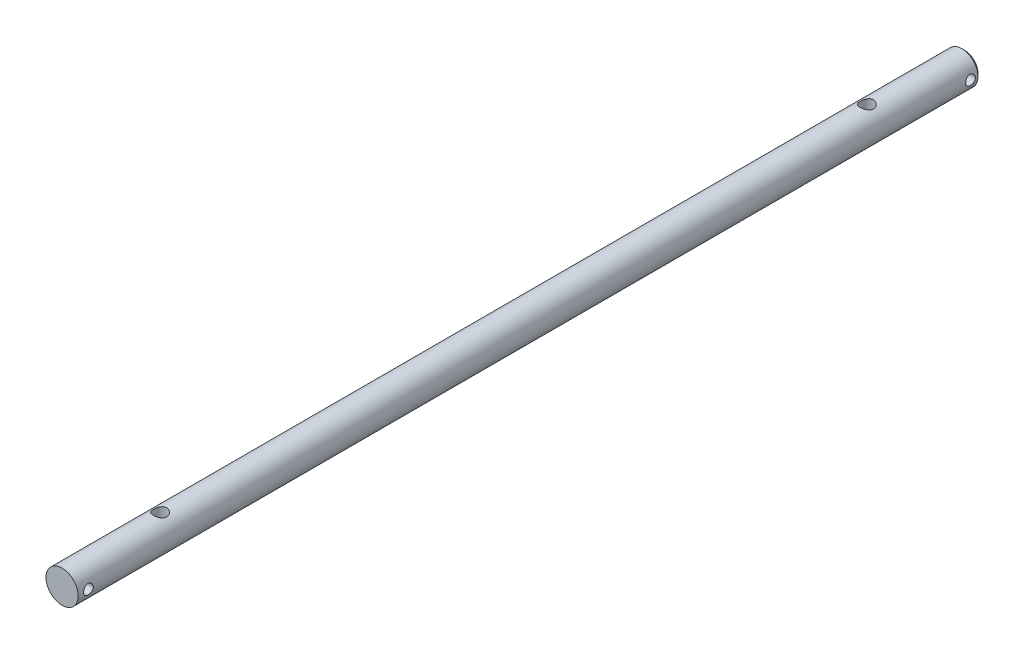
ISO-10303-21;
HEADER;
FILE_DESCRIPTION(('STEP AP214'),'2;1');
FILE_NAME('part.step','',(''),(''),'','','');
FILE_SCHEMA(('AUTOMOTIVE_DESIGN { 1 0 10303 214 1 1 1 1 }'));
ENDSEC;
DATA;
#1=APPLICATION_CONTEXT('core data for automotive mechanical design processes');
#2=APPLICATION_PROTOCOL_DEFINITION('international standard','automotive_design',2000,#1);
#3=PRODUCT_CONTEXT('',#1,'mechanical');
#4=PRODUCT('Part','Part','',(#3));
#5=PRODUCT_RELATED_PRODUCT_CATEGORY('part','',(#4));
#6=PRODUCT_DEFINITION_FORMATION('','',#4);
#7=PRODUCT_DEFINITION_CONTEXT('part definition',#1,'design');
#8=PRODUCT_DEFINITION('design','',#6,#7);
#9=PRODUCT_DEFINITION_SHAPE('','',#8);
#10=(LENGTH_UNIT() NAMED_UNIT(*) SI_UNIT(.MILLI.,.METRE.));
#11=(NAMED_UNIT(*) PLANE_ANGLE_UNIT() SI_UNIT($,.RADIAN.));
#12=(NAMED_UNIT(*) SI_UNIT($,.STERADIAN.) SOLID_ANGLE_UNIT());
#13=UNCERTAINTY_MEASURE_WITH_UNIT(LENGTH_MEASURE(1.E-05),#10,'distance_accuracy_value','');
#14=(GEOMETRIC_REPRESENTATION_CONTEXT(3) GLOBAL_UNCERTAINTY_ASSIGNED_CONTEXT((#13)) GLOBAL_UNIT_ASSIGNED_CONTEXT((#10,
#11,#12)) REPRESENTATION_CONTEXT('',''));
#15=CARTESIAN_POINT('',(0.,0.,0.));
#16=DIRECTION('',(0.,0.,1.));
#17=DIRECTION('',(1.,0.,0.));
#18=AXIS2_PLACEMENT_3D('',#15,#16,#17);
#19=CARTESIAN_POINT('',(0.,0.,444.5));
#20=DIRECTION('',(0.,0.,-1.));
#21=DIRECTION('',(-1.,0.,0.));
#22=AXIS2_PLACEMENT_3D('',#19,#20,#21);
#23=CYLINDRICAL_SURFACE('',#22,7.9375);
#24=CARTESIAN_POINT('',(0.,0.,1.41824457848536));
#25=DIRECTION('',(0.,0.,1.));
#26=DIRECTION('',(1.,0.,0.));
#27=AXIS2_PLACEMENT_3D('',#24,#25,#26);
#28=CIRCLE('',#27,7.9375);
#29=CARTESIAN_POINT('',(7.9375,0.,1.41824457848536));
#30=VERTEX_POINT('',#29);
#31=EDGE_CURVE('E122',#30,#30,#28,.T.);
#32=ORIENTED_EDGE('',*,*,#31,.T.);
#33=EDGE_LOOP('',(#32));
#34=FACE_BOUND('',#33,.T.);
#35=CARTESIAN_POINT('',(0.,-7.9375,51.5239));
#36=CARTESIAN_POINT('',(0.0875530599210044,-7.93749934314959,51.5238990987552));
#37=CARTESIAN_POINT('',(0.175141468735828,-7.93604590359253,51.5203699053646));
#38=CARTESIAN_POINT('',(0.349674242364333,-7.93027671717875,51.5062990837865));
#39=CARTESIAN_POINT('',(0.436618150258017,-7.92595910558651,51.4957528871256));
#40=CARTESIAN_POINT('',(0.695857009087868,-7.9088288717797,51.4536551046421));
#41=CARTESIAN_POINT('',(0.866314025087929,-7.89183927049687,51.4116446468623));
#42=CARTESIAN_POINT('',(1.19655692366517,-7.84856059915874,51.3016368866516));
#43=CARTESIAN_POINT('',(1.35637647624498,-7.8223027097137,51.2337266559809));
#44=CARTESIAN_POINT('',(1.66224186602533,-7.76306120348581,51.0742018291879));
#45=CARTESIAN_POINT('',(1.80829205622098,-7.73007972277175,50.9825947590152));
#46=CARTESIAN_POINT('',(2.08983259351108,-7.65888683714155,50.7735161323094));
#47=CARTESIAN_POINT('',(2.22455413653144,-7.6205070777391,50.6550677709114));
#48=CARTESIAN_POINT('',(2.47288037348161,-7.5435865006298,50.3977328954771));
#49=CARTESIAN_POINT('',(2.58647421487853,-7.50504561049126,50.2588359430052));
#50=CARTESIAN_POINT('',(2.79465670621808,-7.43011705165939,49.9565225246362));
#51=CARTESIAN_POINT('',(2.88808252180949,-7.39391935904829,49.7922533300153));
#52=CARTESIAN_POINT('',(3.04563418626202,-7.33043566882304,49.4486250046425));
#53=CARTESIAN_POINT('',(3.1097747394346,-7.30314520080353,49.2692735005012));
#54=CARTESIAN_POINT('',(3.20378358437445,-7.26238292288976,48.9094115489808));
#55=CARTESIAN_POINT('',(3.23512819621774,-7.24831904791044,48.7293563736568));
#56=CARTESIAN_POINT('',(3.26726348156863,-7.23389512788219,48.3660351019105));
#57=CARTESIAN_POINT('',(3.26807038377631,-7.23352780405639,48.1827707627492));
#58=CARTESIAN_POINT('',(3.24022153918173,-7.24603607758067,47.8327624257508));
#59=CARTESIAN_POINT('',(3.21375012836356,-7.25792988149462,47.6658025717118));
#60=CARTESIAN_POINT('',(3.13575278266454,-7.29196488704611,47.3389464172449));
#61=CARTESIAN_POINT('',(3.08422219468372,-7.3141079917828,47.1790514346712));
#62=CARTESIAN_POINT('',(2.95657151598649,-7.3666425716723,46.8668836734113));
#63=CARTESIAN_POINT('',(2.87995763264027,-7.39719754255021,46.7148415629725));
#64=CARTESIAN_POINT('',(2.70466340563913,-7.46307273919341,46.4251908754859));
#65=CARTESIAN_POINT('',(2.6059744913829,-7.49839481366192,46.2875879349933));
#66=CARTESIAN_POINT('',(2.37981547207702,-7.57335383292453,46.0188314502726));
#67=CARTESIAN_POINT('',(2.25064758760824,-7.61310693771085,45.8891350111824));
#68=CARTESIAN_POINT('',(1.97199073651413,-7.68999570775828,45.6527630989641));
#69=CARTESIAN_POINT('',(1.82249726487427,-7.72713078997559,45.5460927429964));
#70=CARTESIAN_POINT('',(1.50310308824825,-7.79562728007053,45.3567397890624));
#71=CARTESIAN_POINT('',(1.33282650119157,-7.82684408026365,45.2746350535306));
#72=CARTESIAN_POINT('',(0.979267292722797,-7.87888249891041,45.1407441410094));
#73=CARTESIAN_POINT('',(0.795991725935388,-7.89970970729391,45.0889416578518));
#74=CARTESIAN_POINT('',(0.433826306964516,-7.9275865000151,45.0201412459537));
#75=CARTESIAN_POINT('',(0.255367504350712,-7.93540929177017,45.0011869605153));
#76=CARTESIAN_POINT('',(-0.102336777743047,-7.93885310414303,44.9928070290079));
#77=CARTESIAN_POINT('',(-0.281582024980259,-7.93447751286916,45.0033731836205));
#78=CARTESIAN_POINT('',(-0.626707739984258,-7.91451937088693,45.0523207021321));
#79=CARTESIAN_POINT('',(-0.792816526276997,-7.89948546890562,45.0893410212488));
#80=CARTESIAN_POINT('',(-1.11629339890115,-7.86030273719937,45.1882658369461));
#81=CARTESIAN_POINT('',(-1.27366037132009,-7.83615274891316,45.2501734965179));
#82=CARTESIAN_POINT('',(-1.58067601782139,-7.78013402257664,45.3991396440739));
#83=CARTESIAN_POINT('',(-1.72993527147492,-7.74804959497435,45.4869170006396));
#84=CARTESIAN_POINT('',(-2.01213722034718,-7.67960474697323,45.6843386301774));
#85=CARTESIAN_POINT('',(-2.14507314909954,-7.64324256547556,45.7939919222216));
#86=CARTESIAN_POINT('',(-2.4005839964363,-7.56704039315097,46.0409983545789));
#87=CARTESIAN_POINT('',(-2.52179169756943,-7.52713460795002,46.179749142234));
#88=CARTESIAN_POINT('',(-2.73956909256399,-7.4506391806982,46.4762819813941));
#89=CARTESIAN_POINT('',(-2.83613372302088,-7.4140502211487,46.6340679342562));
#90=CARTESIAN_POINT('',(-3.00277654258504,-7.34815673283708,46.9671472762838));
#91=CARTESIAN_POINT('',(-3.07250365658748,-7.3189503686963,47.1426371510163));
#92=CARTESIAN_POINT('',(-3.18084236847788,-7.27252962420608,47.5044409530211));
#93=CARTESIAN_POINT('',(-3.21947872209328,-7.25530570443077,47.6907461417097));
#94=CARTESIAN_POINT('',(-3.26210992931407,-7.23623107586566,48.0537645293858));
#95=CARTESIAN_POINT('',(-3.26849573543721,-7.23331975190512,48.2301426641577));
#96=CARTESIAN_POINT('',(-3.25279307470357,-7.24039494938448,48.5813450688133));
#97=CARTESIAN_POINT('',(-3.23070871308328,-7.25037961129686,48.7561695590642));
#98=CARTESIAN_POINT('',(-3.1606832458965,-7.28116335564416,49.0913614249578));
#99=CARTESIAN_POINT('',(-3.11392710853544,-7.30146537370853,49.2520262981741));
#100=CARTESIAN_POINT('',(-2.99702644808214,-7.35021956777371,49.5632774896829));
#101=CARTESIAN_POINT('',(-2.92687538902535,-7.37867402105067,49.7138609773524));
#102=CARTESIAN_POINT('',(-2.76038854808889,-7.44261733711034,50.0104015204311));
#103=CARTESIAN_POINT('',(-2.66274810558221,-7.47842299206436,50.1555564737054));
#104=CARTESIAN_POINT('',(-2.44589930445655,-7.55212412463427,50.4281726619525));
#105=CARTESIAN_POINT('',(-2.32668378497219,-7.59002029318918,50.5556279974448));
#106=CARTESIAN_POINT('',(-2.06016435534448,-7.6668232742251,50.7984061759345));
#107=CARTESIAN_POINT('',(-1.91147676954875,-7.70561451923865,50.9122508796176));
#108=CARTESIAN_POINT('',(-1.5955536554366,-7.77716179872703,51.1134652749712));
#109=CARTESIAN_POINT('',(-1.4283096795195,-7.8099150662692,51.2008228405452));
#110=CARTESIAN_POINT('',(-1.16866980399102,-7.85147733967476,51.3089159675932));
#111=CARTESIAN_POINT('',(-1.08141427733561,-7.86399724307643,51.3409508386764));
#112=CARTESIAN_POINT('',(-0.904186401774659,-7.88633656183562,51.3975347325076));
#113=CARTESIAN_POINT('',(-0.814215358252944,-7.89615725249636,51.4220872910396));
#114=CARTESIAN_POINT('',(-0.632474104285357,-7.91278688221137,51.463386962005));
#115=CARTESIAN_POINT('',(-0.540708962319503,-7.91960330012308,51.4801534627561));
#116=CARTESIAN_POINT('',(-0.355946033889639,-7.93005394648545,51.5057712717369));
#117=CARTESIAN_POINT('',(-0.262949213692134,-7.93369053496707,51.5146284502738));
#118=CARTESIAN_POINT('',(-0.141483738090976,-7.93628946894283,51.5209550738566));
#119=CARTESIAN_POINT('',(-0.11320114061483,-7.93674317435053,51.5220591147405));
#120=CARTESIAN_POINT('',(-0.0566135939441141,-7.93734854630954,51.5235317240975));
#121=CARTESIAN_POINT('',(-0.0283086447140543,-7.9375002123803,51.5239002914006));
#122=CARTESIAN_POINT('',(0.,-7.9375,51.5239));
#123=B_SPLINE_CURVE_WITH_KNOTS('',3,(#35,#36,#37,#38,#39,#40,#41,#42,#43,#44,#45,#46,#47,#48,
#49,#50,#51,#52,#53,#54,#55,#56,#57,#58,#59,#60,#61,#62,#63,#64,#65,#66,#67,#68,#69,#70,#71,#72,
#73,#74,#75,#76,#77,#78,#79,#80,#81,#82,#83,#84,#85,#86,#87,#88,#89,#90,#91,#92,#93,#94,#95,#96,
#97,#98,#99,#100,#101,#102,#103,#104,#105,#106,#107,#108,#109,#110,#111,#112,#113,#114,#115,
#116,#117,#118,#119,#120,#121,#122),.UNSPECIFIED.,.T.,.F.,(4,2,2,2,2,2,2,2,2,2,2,2,2,2,2,2,2,2,
2,2,2,2,2,2,2,2,2,2,2,2,2,2,2,2,2,2,2,2,2,2,2,2,2,4),(0.,0.262627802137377,0.525426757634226,
1.0517501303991,1.57631944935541,2.1007223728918,2.64867604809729,3.1969104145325,
3.77125564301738,4.34531217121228,4.89224140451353,5.438879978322,5.94490860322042,
6.45103122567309,6.9677855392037,7.48474083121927,8.0441401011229,8.60366356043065,
9.17546733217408,9.74696312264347,10.2830744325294,10.8190368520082,11.3292438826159,
11.8395157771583,12.3655746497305,12.8918508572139,13.4547946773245,14.017854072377,
14.5880472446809,15.1577859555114,15.6845933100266,16.2113247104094,16.7147943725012,
17.2184048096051,17.751839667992,18.2854519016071,18.856494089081,19.4277973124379,
19.7088571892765,19.9897840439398,20.270007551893,20.5500229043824,20.6349385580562,
20.7198543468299),.UNSPECIFIED.);
#124=CARTESIAN_POINT('',(0.,-7.9375,51.5239));
#125=VERTEX_POINT('',#124);
#126=EDGE_CURVE('E43',#125,#125,#123,.T.);
#127=ORIENTED_EDGE('',*,*,#126,.T.);
#128=EDGE_LOOP('',(#127));
#129=FACE_BOUND('',#128,.T.);
#130=CARTESIAN_POINT('',(0.,7.9375,51.5239));
#131=CARTESIAN_POINT('',(-0.0875530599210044,7.93749934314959,51.5238990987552));
#132=CARTESIAN_POINT('',(-0.175141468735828,7.93604590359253,51.5203699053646));
#133=CARTESIAN_POINT('',(-0.349674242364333,7.93027671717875,51.5062990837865));
#134=CARTESIAN_POINT('',(-0.436618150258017,7.92595910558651,51.4957528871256));
#135=CARTESIAN_POINT('',(-0.695857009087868,7.9088288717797,51.4536551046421));
#136=CARTESIAN_POINT('',(-0.866314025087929,7.89183927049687,51.4116446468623));
#137=CARTESIAN_POINT('',(-1.19655692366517,7.84856059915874,51.3016368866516));
#138=CARTESIAN_POINT('',(-1.35637647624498,7.8223027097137,51.2337266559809));
#139=CARTESIAN_POINT('',(-1.66224186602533,7.76306120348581,51.0742018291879));
#140=CARTESIAN_POINT('',(-1.80829205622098,7.73007972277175,50.9825947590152));
#141=CARTESIAN_POINT('',(-2.08983259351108,7.65888683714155,50.7735161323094));
#142=CARTESIAN_POINT('',(-2.22455413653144,7.6205070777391,50.6550677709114));
#143=CARTESIAN_POINT('',(-2.47288037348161,7.5435865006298,50.3977328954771));
#144=CARTESIAN_POINT('',(-2.58647421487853,7.50504561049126,50.2588359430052));
#145=CARTESIAN_POINT('',(-2.79465670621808,7.43011705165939,49.9565225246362));
#146=CARTESIAN_POINT('',(-2.88808252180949,7.39391935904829,49.7922533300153));
#147=CARTESIAN_POINT('',(-3.04563418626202,7.33043566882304,49.4486250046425));
#148=CARTESIAN_POINT('',(-3.1097747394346,7.30314520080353,49.2692735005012));
#149=CARTESIAN_POINT('',(-3.20378358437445,7.26238292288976,48.9094115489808));
#150=CARTESIAN_POINT('',(-3.23512819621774,7.24831904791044,48.7293563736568));
#151=CARTESIAN_POINT('',(-3.26726348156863,7.23389512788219,48.3660351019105));
#152=CARTESIAN_POINT('',(-3.26807038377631,7.23352780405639,48.1827707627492));
#153=CARTESIAN_POINT('',(-3.24022153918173,7.24603607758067,47.8327624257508));
#154=CARTESIAN_POINT('',(-3.21375012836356,7.25792988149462,47.6658025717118));
#155=CARTESIAN_POINT('',(-3.13575278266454,7.29196488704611,47.3389464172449));
#156=CARTESIAN_POINT('',(-3.08422219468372,7.3141079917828,47.1790514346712));
#157=CARTESIAN_POINT('',(-2.95657151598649,7.3666425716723,46.8668836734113));
#158=CARTESIAN_POINT('',(-2.87995763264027,7.39719754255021,46.7148415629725));
#159=CARTESIAN_POINT('',(-2.70466340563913,7.46307273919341,46.4251908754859));
#160=CARTESIAN_POINT('',(-2.6059744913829,7.49839481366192,46.2875879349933));
#161=CARTESIAN_POINT('',(-2.37981547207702,7.57335383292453,46.0188314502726));
#162=CARTESIAN_POINT('',(-2.25064758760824,7.61310693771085,45.8891350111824));
#163=CARTESIAN_POINT('',(-1.97199073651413,7.68999570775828,45.6527630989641));
#164=CARTESIAN_POINT('',(-1.82249726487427,7.72713078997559,45.5460927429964));
#165=CARTESIAN_POINT('',(-1.50310308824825,7.79562728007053,45.3567397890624));
#166=CARTESIAN_POINT('',(-1.33282650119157,7.82684408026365,45.2746350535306));
#167=CARTESIAN_POINT('',(-0.979267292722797,7.87888249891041,45.1407441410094));
#168=CARTESIAN_POINT('',(-0.795991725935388,7.89970970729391,45.0889416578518));
#169=CARTESIAN_POINT('',(-0.433826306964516,7.9275865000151,45.0201412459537));
#170=CARTESIAN_POINT('',(-0.255367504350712,7.93540929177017,45.0011869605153));
#171=CARTESIAN_POINT('',(0.102336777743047,7.93885310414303,44.9928070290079));
#172=CARTESIAN_POINT('',(0.281582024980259,7.93447751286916,45.0033731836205));
#173=CARTESIAN_POINT('',(0.626707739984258,7.91451937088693,45.0523207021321));
#174=CARTESIAN_POINT('',(0.792816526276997,7.89948546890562,45.0893410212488));
#175=CARTESIAN_POINT('',(1.11629339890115,7.86030273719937,45.1882658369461));
#176=CARTESIAN_POINT('',(1.27366037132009,7.83615274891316,45.2501734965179));
#177=CARTESIAN_POINT('',(1.58067601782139,7.78013402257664,45.3991396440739));
#178=CARTESIAN_POINT('',(1.72993527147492,7.74804959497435,45.4869170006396));
#179=CARTESIAN_POINT('',(2.01213722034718,7.67960474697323,45.6843386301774));
#180=CARTESIAN_POINT('',(2.14507314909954,7.64324256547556,45.7939919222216));
#181=CARTESIAN_POINT('',(2.4005839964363,7.56704039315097,46.0409983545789));
#182=CARTESIAN_POINT('',(2.52179169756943,7.52713460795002,46.179749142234));
#183=CARTESIAN_POINT('',(2.73956909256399,7.4506391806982,46.4762819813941));
#184=CARTESIAN_POINT('',(2.83613372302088,7.4140502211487,46.6340679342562));
#185=CARTESIAN_POINT('',(3.00277654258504,7.34815673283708,46.9671472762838));
#186=CARTESIAN_POINT('',(3.07250365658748,7.3189503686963,47.1426371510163));
#187=CARTESIAN_POINT('',(3.18084236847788,7.27252962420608,47.5044409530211));
#188=CARTESIAN_POINT('',(3.21947872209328,7.25530570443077,47.6907461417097));
#189=CARTESIAN_POINT('',(3.26210992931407,7.23623107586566,48.0537645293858));
#190=CARTESIAN_POINT('',(3.26849573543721,7.23331975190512,48.2301426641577));
#191=CARTESIAN_POINT('',(3.25279307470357,7.24039494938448,48.5813450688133));
#192=CARTESIAN_POINT('',(3.23070871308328,7.25037961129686,48.7561695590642));
#193=CARTESIAN_POINT('',(3.1606832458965,7.28116335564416,49.0913614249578));
#194=CARTESIAN_POINT('',(3.11392710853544,7.30146537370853,49.2520262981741));
#195=CARTESIAN_POINT('',(2.99702644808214,7.35021956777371,49.5632774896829));
#196=CARTESIAN_POINT('',(2.92687538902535,7.37867402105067,49.7138609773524));
#197=CARTESIAN_POINT('',(2.76038854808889,7.44261733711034,50.0104015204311));
#198=CARTESIAN_POINT('',(2.66274810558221,7.47842299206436,50.1555564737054));
#199=CARTESIAN_POINT('',(2.44589930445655,7.55212412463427,50.4281726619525));
#200=CARTESIAN_POINT('',(2.32668378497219,7.59002029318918,50.5556279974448));
#201=CARTESIAN_POINT('',(2.06016435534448,7.6668232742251,50.7984061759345));
#202=CARTESIAN_POINT('',(1.91147676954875,7.70561451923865,50.9122508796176));
#203=CARTESIAN_POINT('',(1.5955536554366,7.77716179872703,51.1134652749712));
#204=CARTESIAN_POINT('',(1.4283096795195,7.8099150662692,51.2008228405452));
#205=CARTESIAN_POINT('',(1.16866980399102,7.85147733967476,51.3089159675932));
#206=CARTESIAN_POINT('',(1.08141427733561,7.86399724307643,51.3409508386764));
#207=CARTESIAN_POINT('',(0.904186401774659,7.88633656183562,51.3975347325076));
#208=CARTESIAN_POINT('',(0.814215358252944,7.89615725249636,51.4220872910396));
#209=CARTESIAN_POINT('',(0.632474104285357,7.91278688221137,51.463386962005));
#210=CARTESIAN_POINT('',(0.540708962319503,7.91960330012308,51.4801534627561));
#211=CARTESIAN_POINT('',(0.355946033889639,7.93005394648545,51.5057712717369));
#212=CARTESIAN_POINT('',(0.262949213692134,7.93369053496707,51.5146284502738));
#213=CARTESIAN_POINT('',(0.141483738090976,7.93628946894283,51.5209550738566));
#214=CARTESIAN_POINT('',(0.11320114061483,7.93674317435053,51.5220591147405));
#215=CARTESIAN_POINT('',(0.0566135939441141,7.93734854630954,51.5235317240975));
#216=CARTESIAN_POINT('',(0.0283086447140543,7.9375002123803,51.5239002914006));
#217=CARTESIAN_POINT('',(0.,7.9375,51.5239));
#218=B_SPLINE_CURVE_WITH_KNOTS('',3,(#130,#131,#132,#133,#134,#135,#136,#137,#138,#139,#140,
#141,#142,#143,#144,#145,#146,#147,#148,#149,#150,#151,#152,#153,#154,#155,#156,#157,#158,#159,
#160,#161,#162,#163,#164,#165,#166,#167,#168,#169,#170,#171,#172,#173,#174,#175,#176,#177,#178,
#179,#180,#181,#182,#183,#184,#185,#186,#187,#188,#189,#190,#191,#192,#193,#194,#195,#196,#197,
#198,#199,#200,#201,#202,#203,#204,#205,#206,#207,#208,#209,#210,#211,#212,#213,#214,#215,#216,
#217),.UNSPECIFIED.,.T.,.F.,(4,2,2,2,2,2,2,2,2,2,2,2,2,2,2,2,2,2,2,2,2,2,2,2,2,2,2,2,2,2,2,2,2,
2,2,2,2,2,2,2,2,2,2,4),(0.,0.262627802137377,0.525426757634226,1.0517501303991,1.57631944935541,
2.1007223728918,2.64867604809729,3.1969104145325,3.77125564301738,4.34531217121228,
4.89224140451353,5.438879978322,5.94490860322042,6.45103122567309,6.9677855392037,
7.48474083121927,8.0441401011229,8.60366356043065,9.17546733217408,9.74696312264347,
10.2830744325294,10.8190368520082,11.3292438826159,11.8395157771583,12.3655746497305,
12.8918508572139,13.4547946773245,14.017854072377,14.5880472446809,15.1577859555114,
15.6845933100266,16.2113247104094,16.7147943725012,17.2184048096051,17.751839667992,
18.2854519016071,18.856494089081,19.4277973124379,19.7088571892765,19.9897840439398,
20.270007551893,20.5500229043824,20.6349385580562,20.7198543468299),.UNSPECIFIED.);
#219=CARTESIAN_POINT('',(0.,7.9375,51.5239));
#220=VERTEX_POINT('',#219);
#221=EDGE_CURVE('E69',#220,#220,#218,.T.);
#222=ORIENTED_EDGE('',*,*,#221,.T.);
#223=EDGE_LOOP('',(#222));
#224=FACE_BOUND('',#223,.T.);
#225=CARTESIAN_POINT('',(-7.9375,0.,7.45648797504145));
#226=CARTESIAN_POINT('',(-7.93749890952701,-0.130707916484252,7.44820757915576));
#227=CARTESIAN_POINT('',(-7.9342407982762,-0.260747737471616,7.4291101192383));
#228=CARTESIAN_POINT('',(-7.92176105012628,-0.515673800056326,7.36990702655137));
#229=CARTESIAN_POINT('',(-7.91253734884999,-0.640558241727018,7.32979412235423));
#230=CARTESIAN_POINT('',(-7.88932878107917,-0.881496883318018,7.22994742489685));
#231=CARTESIAN_POINT('',(-7.87535113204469,-0.997564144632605,7.17024337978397));
#232=CARTESIAN_POINT('',(-7.84426616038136,-1.21812021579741,7.03296056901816));
#233=CARTESIAN_POINT('',(-7.82715846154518,-1.32260763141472,6.9553796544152));
#234=CARTESIAN_POINT('',(-7.79127519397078,-1.51995497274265,6.78221332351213));
#235=CARTESIAN_POINT('',(-7.77246826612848,-1.61245146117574,6.68622007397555));
#236=CARTESIAN_POINT('',(-7.73576226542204,-1.78024816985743,6.48005405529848));
#237=CARTESIAN_POINT('',(-7.71786329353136,-1.85554648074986,6.36987971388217));
#238=CARTESIAN_POINT('',(-7.68485304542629,-1.98788376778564,6.13634402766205));
#239=CARTESIAN_POINT('',(-7.66978929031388,-2.04462156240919,6.01280471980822));
#240=CARTESIAN_POINT('',(-7.64474544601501,-2.13636526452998,5.75742199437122));
#241=CARTESIAN_POINT('',(-7.63476406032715,-2.17137671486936,5.6255807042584));
#242=CARTESIAN_POINT('',(-7.62143239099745,-2.21771146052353,5.36152755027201));
#243=CARTESIAN_POINT('',(-7.61789351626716,-2.22970902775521,5.22944360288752));
#244=CARTESIAN_POINT('',(-7.61733309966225,-2.23162428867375,4.96511369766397));
#245=CARTESIAN_POINT('',(-7.62031056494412,-2.22154534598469,4.83286776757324));
#246=CARTESIAN_POINT('',(-7.63222803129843,-2.18023753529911,4.57555905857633));
#247=CARTESIAN_POINT('',(-7.64101121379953,-2.14956459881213,4.45039892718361));
#248=CARTESIAN_POINT('',(-7.6633114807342,-2.06864970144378,4.20702494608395));
#249=CARTESIAN_POINT('',(-7.67682919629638,-2.0184051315,4.08881202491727));
#250=CARTESIAN_POINT('',(-7.70734938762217,-1.8985675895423,3.85990525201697));
#251=CARTESIAN_POINT('',(-7.72441938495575,-1.82858866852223,3.74942273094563));
#252=CARTESIAN_POINT('',(-7.75989375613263,-1.67165011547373,3.54148753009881));
#253=CARTESIAN_POINT('',(-7.77829841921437,-1.58468679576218,3.44403768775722));
#254=CARTESIAN_POINT('',(-7.8149880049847,-1.3927370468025,3.26153160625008));
#255=CARTESIAN_POINT('',(-7.83324790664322,-1.2872412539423,3.1770048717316));
#256=CARTESIAN_POINT('',(-7.86679382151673,-1.06314482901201,3.02681780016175));
#257=CARTESIAN_POINT('',(-7.88207998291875,-0.944544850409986,2.96115652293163));
#258=CARTESIAN_POINT('',(-7.90767767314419,-0.698373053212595,2.85115099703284));
#259=CARTESIAN_POINT('',(-7.91802493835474,-0.570873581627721,2.80665362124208));
#260=CARTESIAN_POINT('',(-7.93252461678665,-0.309866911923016,2.73980131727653));
#261=CARTESIAN_POINT('',(-7.93667873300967,-0.176361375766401,2.71744030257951));
#262=CARTESIAN_POINT('',(-7.93807397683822,0.0876213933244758,2.69603458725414));
#263=CARTESIAN_POINT('',(-7.93556185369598,0.218031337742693,2.69616876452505));
#264=CARTESIAN_POINT('',(-7.92422471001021,0.476803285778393,2.71763980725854));
#265=CARTESIAN_POINT('',(-7.91539999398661,0.605165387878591,2.73897564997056));
#266=CARTESIAN_POINT('',(-7.89229718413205,0.855086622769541,2.80175622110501));
#267=CARTESIAN_POINT('',(-7.87806916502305,0.976696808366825,2.84301722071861));
#268=CARTESIAN_POINT('',(-7.84543099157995,1.21126293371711,2.94423249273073));
#269=CARTESIAN_POINT('',(-7.8270200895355,1.32421732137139,3.00419010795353));
#270=CARTESIAN_POINT('',(-7.78701002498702,1.54243628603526,3.14344669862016));
#271=CARTESIAN_POINT('',(-7.76532393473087,1.6473103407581,3.22333247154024));
#272=CARTESIAN_POINT('',(-7.7213581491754,1.84243220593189,3.39921213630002));
#273=CARTESIAN_POINT('',(-7.69907830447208,1.93267629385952,3.49521011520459));
#274=CARTESIAN_POINT('',(-7.65547249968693,2.09887460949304,3.70426268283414));
#275=CARTESIAN_POINT('',(-7.6341990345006,2.17428628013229,3.81776088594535));
#276=CARTESIAN_POINT('',(-7.59579176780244,2.30488832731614,4.05649889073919));
#277=CARTESIAN_POINT('',(-7.57865728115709,2.36008205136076,4.18173674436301));
#278=CARTESIAN_POINT('',(-7.5508902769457,2.44745535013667,4.43783894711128));
#279=CARTESIAN_POINT('',(-7.54013298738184,2.48007880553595,4.56853775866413));
#280=CARTESIAN_POINT('',(-7.52593900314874,2.52283032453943,4.83393651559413));
#281=CARTESIAN_POINT('',(-7.52249969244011,2.5329664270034,4.96863501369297));
#282=CARTESIAN_POINT('',(-7.5233584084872,2.53040993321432,5.23148375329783));
#283=CARTESIAN_POINT('',(-7.52730339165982,2.51875900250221,5.35964667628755));
#284=CARTESIAN_POINT('',(-7.54177095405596,2.47509956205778,5.6120628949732));
#285=CARTESIAN_POINT('',(-7.55229371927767,2.44309047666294,5.73631608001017));
#286=CARTESIAN_POINT('',(-7.57870652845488,2.35987283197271,5.97742280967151));
#287=CARTESIAN_POINT('',(-7.59459061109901,2.30868559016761,6.09428440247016));
#288=CARTESIAN_POINT('',(-7.63004725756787,2.1886499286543,6.31794141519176));
#289=CARTESIAN_POINT('',(-7.64962067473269,2.11979742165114,6.42473449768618));
#290=CARTESIAN_POINT('',(-7.6914615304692,1.96270591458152,6.63043118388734));
#291=CARTESIAN_POINT('',(-7.7138111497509,1.87372557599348,6.72875231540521));
#292=CARTESIAN_POINT('',(-7.75816566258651,1.6806461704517,6.90935741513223));
#293=CARTESIAN_POINT('',(-7.7801704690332,1.57654334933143,6.99163738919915));
#294=CARTESIAN_POINT('',(-7.82220120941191,1.35289866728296,7.13987710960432));
#295=CARTESIAN_POINT('',(-7.84216125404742,1.2330271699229,7.20535978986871));
#296=CARTESIAN_POINT('',(-7.87736555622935,0.98329904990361,7.31504041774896));
#297=CARTESIAN_POINT('',(-7.89261234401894,0.853447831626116,7.35924979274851));
#298=CARTESIAN_POINT('',(-7.91541772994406,0.60327917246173,7.42092938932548));
#299=CARTESIAN_POINT('',(-7.9236716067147,0.483646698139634,7.44094072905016));
#300=CARTESIAN_POINT('',(-7.93471284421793,0.242485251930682,7.46254998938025));
#301=CARTESIAN_POINT('',(-7.93750100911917,0.120956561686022,7.464150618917));
#302=CARTESIAN_POINT('',(-7.9375,0.,7.45648797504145));
#303=B_SPLINE_CURVE_WITH_KNOTS('',3,(#225,#226,#227,#228,#229,#230,#231,#232,#233,#234,#235,
#236,#237,#238,#239,#240,#241,#242,#243,#244,#245,#246,#247,#248,#249,#250,#251,#252,#253,#254,
#255,#256,#257,#258,#259,#260,#261,#262,#263,#264,#265,#266,#267,#268,#269,#270,#271,#272,#273,
#274,#275,#276,#277,#278,#279,#280,#281,#282,#283,#284,#285,#286,#287,#288,#289,#290,#291,#292,
#293,#294,#295,#296,#297,#298,#299,#300,#301,#302),.UNSPECIFIED.,.T.,.F.,(4,2,2,2,2,2,2,2,2,2,2,
2,2,2,2,2,2,2,2,2,2,2,2,2,2,2,2,2,2,2,2,2,2,2,2,2,2,2,4),(0.,0.392462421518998,
0.785060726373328,1.17706562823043,1.56911767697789,1.97114376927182,2.37321447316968,
2.78151866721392,3.1897186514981,3.58576454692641,3.98175010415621,4.36745428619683,
4.75320990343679,5.14710646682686,5.54108864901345,5.94837227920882,6.35563560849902,
6.75990566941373,7.16406454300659,7.55347409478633,7.9428648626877,8.32873172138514,
8.71466760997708,9.11368746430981,9.51280868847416,9.92455977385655,10.3362426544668,
10.7395795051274,11.1427721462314,11.5271786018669,11.9115959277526,12.2955872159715,
12.6796674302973,13.0812758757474,13.4829841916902,13.8950807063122,14.3069556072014,
14.6701921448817,15.0333752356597),.UNSPECIFIED.);
#304=CARTESIAN_POINT('',(-7.9375,0.,7.45648797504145));
#305=VERTEX_POINT('',#304);
#306=EDGE_CURVE('E87',#305,#305,#303,.T.);
#307=ORIENTED_EDGE('',*,*,#306,.T.);
#308=EDGE_LOOP('',(#307));
#309=FACE_BOUND('',#308,.T.);
#310=CARTESIAN_POINT('',(7.93607269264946,0.150520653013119,2.69875000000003));
#311=CARTESIAN_POINT('',(7.93854156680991,0.0203059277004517,2.69875126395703));
#312=CARTESIAN_POINT('',(7.93777726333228,-0.109983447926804,2.70946578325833));
#313=CARTESIAN_POINT('',(7.9300585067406,-0.366894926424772,2.75199750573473));
#314=CARTESIAN_POINT('',(7.92310255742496,-0.49351613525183,2.78381980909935));
#315=CARTESIAN_POINT('',(7.90395291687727,-0.739342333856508,2.86746000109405));
#316=CARTESIAN_POINT('',(7.89176611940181,-0.858556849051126,2.91925156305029));
#317=CARTESIAN_POINT('',(7.86360672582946,-1.08665561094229,3.04125438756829));
#318=CARTESIAN_POINT('',(7.84763361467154,-1.19553844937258,3.11146815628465));
#319=CARTESIAN_POINT('',(7.81329362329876,-1.40272820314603,3.2702479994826));
#320=CARTESIAN_POINT('',(7.79487927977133,-1.50072615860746,3.35920686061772));
#321=CARTESIAN_POINT('',(7.75807065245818,-1.68068444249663,3.55211110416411));
#322=CARTESIAN_POINT('',(7.73967637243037,-1.76264215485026,3.65605892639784));
#323=CARTESIAN_POINT('',(7.70462771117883,-1.91010891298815,3.87898582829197));
#324=CARTESIAN_POINT('',(7.68802527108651,-1.97517918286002,3.99826420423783));
#325=CARTESIAN_POINT('',(7.65918084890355,-2.0842406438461,4.24658959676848));
#326=CARTESIAN_POINT('',(7.64693802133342,-2.12823592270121,4.37563471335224));
#327=CARTESIAN_POINT('',(7.62864664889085,-2.19289101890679,4.63676933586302));
#328=CARTESIAN_POINT('',(7.6224644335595,-2.21405549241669,4.76872423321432));
#329=CARTESIAN_POINT('',(7.61663919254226,-2.2340166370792,5.03444551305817));
#330=CARTESIAN_POINT('',(7.61699474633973,-2.23281816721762,5.16821149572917));
#331=CARTESIAN_POINT('',(7.62407457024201,-2.20851408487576,5.42918670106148));
#332=CARTESIAN_POINT('',(7.6305932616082,-2.18611559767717,5.55646831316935));
#333=CARTESIAN_POINT('',(7.6488918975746,-2.12119891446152,5.80538979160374));
#334=CARTESIAN_POINT('',(7.66067232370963,-2.07867887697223,5.92702914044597));
#335=CARTESIAN_POINT('',(7.68825837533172,-1.9742153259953,6.16290719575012));
#336=CARTESIAN_POINT('',(7.70411035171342,-1.9120461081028,6.27704028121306));
#337=CARTESIAN_POINT('',(7.73793553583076,-1.77018742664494,6.49350138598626));
#338=CARTESIAN_POINT('',(7.7559092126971,-1.6904940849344,6.59582678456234));
#339=CARTESIAN_POINT('',(7.79263325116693,-1.51238923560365,6.78968719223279));
#340=CARTESIAN_POINT('',(7.81138802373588,-1.41340086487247,6.88069228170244));
#341=CARTESIAN_POINT('',(7.84680489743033,-1.20129212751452,7.04492848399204));
#342=CARTESIAN_POINT('',(7.86346693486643,-1.08817133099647,7.11815905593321));
#343=CARTESIAN_POINT('',(7.8927193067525,-0.850441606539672,7.24485833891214));
#344=CARTESIAN_POINT('',(7.90529840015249,-0.725802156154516,7.29827254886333));
#345=CARTESIAN_POINT('',(7.92468544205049,-0.468867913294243,7.38325968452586));
#346=CARTESIAN_POINT('',(7.93149496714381,-0.336575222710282,7.41483857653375));
#347=CARTESIAN_POINT('',(7.93821918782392,-0.0730824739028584,7.4543370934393));
#348=CARTESIAN_POINT('',(7.93836709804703,0.0579934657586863,7.46304690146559));
#349=CARTESIAN_POINT('',(7.93214094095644,0.319630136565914,7.45883732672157));
#350=CARTESIAN_POINT('',(7.92576756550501,0.45019092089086,7.44592023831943));
#351=CARTESIAN_POINT('',(7.90717104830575,0.704661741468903,7.39942049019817));
#352=CARTESIAN_POINT('',(7.89505595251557,0.828649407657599,7.36621637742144));
#353=CARTESIAN_POINT('',(7.86609083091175,1.06921177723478,7.28060571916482));
#354=CARTESIAN_POINT('',(7.84924014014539,1.18578543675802,7.22819647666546));
#355=CARTESIAN_POINT('',(7.81181125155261,1.41173345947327,7.10404621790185));
#356=CARTESIAN_POINT('',(7.79114372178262,1.52082377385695,7.03181574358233));
#357=CARTESIAN_POINT('',(7.7483678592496,1.72559037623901,6.87066806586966));
#358=CARTESIAN_POINT('',(7.72625914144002,1.82126305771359,6.78174639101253));
#359=CARTESIAN_POINT('',(7.68193003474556,2.00016907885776,6.5857881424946));
#360=CARTESIAN_POINT('',(7.65973612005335,2.08280685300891,6.47820049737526));
#361=CARTESIAN_POINT('',(7.61852106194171,2.22886132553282,6.25012158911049));
#362=CARTESIAN_POINT('',(7.59949975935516,2.29227898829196,6.12963097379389));
#363=CARTESIAN_POINT('',(7.56699437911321,2.39739908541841,5.88003793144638));
#364=CARTESIAN_POINT('',(7.55346390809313,2.43928429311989,5.75101884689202));
#365=CARTESIAN_POINT('',(7.53339375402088,2.50058927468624,5.48723970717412));
#366=CARTESIAN_POINT('',(7.52685132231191,2.52001788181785,5.35248193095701));
#367=CARTESIAN_POINT('',(7.52172770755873,2.53526598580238,5.08791886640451));
#368=CARTESIAN_POINT('',(7.52278383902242,2.53216096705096,4.95818162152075));
#369=CARTESIAN_POINT('',(7.53187321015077,2.50499359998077,4.70118135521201));
#370=CARTESIAN_POINT('',(7.53990614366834,2.4809321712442,4.5739182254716));
#371=CARTESIAN_POINT('',(7.56184780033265,2.4132126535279,4.32718970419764));
#372=CARTESIAN_POINT('',(7.5756738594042,2.36982974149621,4.20764090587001));
#373=CARTESIAN_POINT('',(7.60769550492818,2.26492157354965,3.97742521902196));
#374=CARTESIAN_POINT('',(7.62589197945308,2.20339262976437,3.8667601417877));
#375=CARTESIAN_POINT('',(7.66562063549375,2.06102695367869,3.65258366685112));
#376=CARTESIAN_POINT('',(7.68725837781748,1.97950678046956,3.54954621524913));
#377=CARTESIAN_POINT('',(7.73109022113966,1.80072488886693,3.35827902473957));
#378=CARTESIAN_POINT('',(7.75328448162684,1.70345861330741,3.27005358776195));
#379=CARTESIAN_POINT('',(7.79681357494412,1.49186423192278,3.10780925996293));
#380=CARTESIAN_POINT('',(7.81809084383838,1.37705685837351,3.03439817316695));
#381=CARTESIAN_POINT('',(7.85671826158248,1.13610540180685,2.90802821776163));
#382=CARTESIAN_POINT('',(7.87407007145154,1.00996614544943,2.85506069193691));
#383=CARTESIAN_POINT('',(7.90165460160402,0.762686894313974,2.77548639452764));
#384=CARTESIAN_POINT('',(7.91241905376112,0.642272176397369,2.74680192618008));
#385=CARTESIAN_POINT('',(7.92845369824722,0.398100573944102,2.70843503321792));
#386=CARTESIAN_POINT('',(7.93372499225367,0.274344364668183,2.69874879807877));
#387=CARTESIAN_POINT('',(7.93607269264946,0.150520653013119,2.69875000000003));
#388=B_SPLINE_CURVE_WITH_KNOTS('',3,(#310,#311,#312,#313,#314,#315,#316,#317,#318,#319,#320,
#321,#322,#323,#324,#325,#326,#327,#328,#329,#330,#331,#332,#333,#334,#335,#336,#337,#338,#339,
#340,#341,#342,#343,#344,#345,#346,#347,#348,#349,#350,#351,#352,#353,#354,#355,#356,#357,#358,
#359,#360,#361,#362,#363,#364,#365,#366,#367,#368,#369,#370,#371,#372,#373,#374,#375,#376,#377,
#378,#379,#380,#381,#382,#383,#384,#385,#386,#387),.UNSPECIFIED.,.T.,.F.,(4,2,2,2,2,2,2,2,2,2,2,
2,2,2,2,2,2,2,2,2,2,2,2,2,2,2,2,2,2,2,2,2,2,2,2,2,2,2,4),(0.,0.390262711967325,
0.780619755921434,1.17046391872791,1.56036114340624,1.95942828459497,2.35856045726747,
2.76720910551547,3.1757784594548,3.57511901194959,3.97437279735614,4.36076202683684,
4.74718662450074,5.13822198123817,5.52934396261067,5.93473648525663,6.34014134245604,
6.7466530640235,7.15305366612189,7.54521522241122,7.93733517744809,8.32235278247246,
8.70742447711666,9.10302641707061,9.498734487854,9.90917152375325,10.319587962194,
10.7264606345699,11.1331732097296,11.5206064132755,11.908022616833,12.2900894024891,
12.6722338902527,13.0699192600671,13.4677199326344,13.8794923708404,14.2910902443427,
14.6622730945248,15.0333814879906),.UNSPECIFIED.);
#389=CARTESIAN_POINT('',(7.93607269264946,0.150520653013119,2.69875000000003));
#390=VERTEX_POINT('',#389);
#391=EDGE_CURVE('E98',#390,#390,#388,.T.);
#392=ORIENTED_EDGE('',*,*,#391,.T.);
#393=EDGE_LOOP('',(#392));
#394=FACE_BOUND('',#393,.T.);
#395=CARTESIAN_POINT('',(0.,0.,444.5));
#396=DIRECTION('',(0.,0.,1.));
#397=DIRECTION('',(1.,0.,0.));
#398=AXIS2_PLACEMENT_3D('',#395,#396,#397);
#399=CIRCLE('',#398,7.9375);
#400=CARTESIAN_POINT('',(7.9375,0.,444.5));
#401=VERTEX_POINT('',#400);
#402=EDGE_CURVE('E120',#401,#401,#399,.T.);
#403=ORIENTED_EDGE('',*,*,#402,.F.);
#404=EDGE_LOOP('',(#403));
#405=FACE_BOUND('',#404,.T.);
#406=CARTESIAN_POINT('',(7.93607269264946,0.150520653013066,437.03875));
#407=CARTESIAN_POINT('',(7.93358511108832,0.281603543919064,437.038751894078));
#408=CARTESIAN_POINT('',(7.92782086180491,0.412643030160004,437.049610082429));
#409=CARTESIAN_POINT('',(7.91016586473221,0.67077815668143,437.092593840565));
#410=CARTESIAN_POINT('',(7.89827294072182,0.79787237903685,437.124726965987));
#411=CARTESIAN_POINT('',(7.86947235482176,1.04436357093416,437.209041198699));
#412=CARTESIAN_POINT('',(7.85257287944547,1.16377272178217,437.261189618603));
#413=CARTESIAN_POINT('',(7.815327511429,1.39210723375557,437.383919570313));
#414=CARTESIAN_POINT('',(7.79498117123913,1.50103123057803,437.454503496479));
#415=CARTESIAN_POINT('',(7.75214805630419,1.70870506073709,437.614433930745));
#416=CARTESIAN_POINT('',(7.72961715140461,1.80708218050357,437.704252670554));
#417=CARTESIAN_POINT('',(7.68518071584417,1.98760248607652,437.899103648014));
#418=CARTESIAN_POINT('',(7.66327529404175,2.06974286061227,438.004138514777));
#419=CARTESIAN_POINT('',(7.62196578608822,2.21710135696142,438.229179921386));
#420=CARTESIAN_POINT('',(7.60262318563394,2.28193207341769,438.349452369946));
#421=CARTESIAN_POINT('',(7.56926567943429,2.39026369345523,438.599935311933));
#422=CARTESIAN_POINT('',(7.5552492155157,2.43377083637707,438.73014288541));
#423=CARTESIAN_POINT('',(7.53466635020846,2.49675386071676,438.992131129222));
#424=CARTESIAN_POINT('',(7.52786368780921,2.51699379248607,439.123709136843));
#425=CARTESIAN_POINT('',(7.52173372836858,2.535257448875,439.388555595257));
#426=CARTESIAN_POINT('',(7.52240442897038,2.5332871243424,439.521823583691));
#427=CARTESIAN_POINT('',(7.53095152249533,2.50775456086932,439.780594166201));
#428=CARTESIAN_POINT('',(7.53853755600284,2.48506232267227,439.906193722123));
#429=CARTESIAN_POINT('',(7.55963401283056,2.42012272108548,440.151700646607));
#430=CARTESIAN_POINT('',(7.57314506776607,2.377873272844,440.271607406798));
#431=CARTESIAN_POINT('',(7.60487693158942,2.2743598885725,440.504507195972));
#432=CARTESIAN_POINT('',(7.62316828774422,2.2128081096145,440.617362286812));
#433=CARTESIAN_POINT('',(7.66245868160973,2.07265956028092,440.831421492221));
#434=CARTESIAN_POINT('',(7.68345843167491,1.99405830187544,440.93262252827));
#435=CARTESIAN_POINT('',(7.72713690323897,1.81765948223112,441.125543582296));
#436=CARTESIAN_POINT('',(7.74984803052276,1.71912876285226,441.21658706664));
#437=CARTESIAN_POINT('',(7.79368696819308,1.50796664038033,441.381020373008));
#438=CARTESIAN_POINT('',(7.8148146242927,1.39533386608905,441.454408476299));
#439=CARTESIAN_POINT('',(7.85358156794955,1.15750515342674,441.582115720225));
#440=CARTESIAN_POINT('',(7.87117983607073,1.03218441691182,441.636215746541));
#441=CARTESIAN_POINT('',(7.90078710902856,0.773551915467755,441.722334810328));
#442=CARTESIAN_POINT('',(7.91279769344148,0.640242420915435,441.754360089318));
#443=CARTESIAN_POINT('',(7.92973078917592,0.374617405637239,441.794343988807));
#444=CARTESIAN_POINT('',(7.93489587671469,0.24244301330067,441.803137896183));
#445=CARTESIAN_POINT('',(7.93856815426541,-0.0216157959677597,441.798686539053));
#446=CARTESIAN_POINT('',(7.93707642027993,-0.153500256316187,441.78544483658));
#447=CARTESIAN_POINT('',(7.92793719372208,-0.409508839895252,441.738019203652));
#448=CARTESIAN_POINT('',(7.92045703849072,-0.533746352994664,441.704410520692));
#449=CARTESIAN_POINT('',(7.90051665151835,-0.774846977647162,441.617830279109));
#450=CARTESIAN_POINT('',(7.88805592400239,-0.8917093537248,441.564856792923));
#451=CARTESIAN_POINT('',(7.85932081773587,-1.11720969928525,441.439935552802));
#452=CARTESIAN_POINT('',(7.84297892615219,-1.22565091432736,441.367648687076));
#453=CARTESIAN_POINT('',(7.80846140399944,-1.42916369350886,441.206561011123));
#454=CARTESIAN_POINT('',(7.79028534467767,-1.52423211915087,441.117756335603));
#455=CARTESIAN_POINT('',(7.75347612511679,-1.70177395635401,440.92245672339));
#456=CARTESIAN_POINT('',(7.73484944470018,-1.78368508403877,440.815448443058));
#457=CARTESIAN_POINT('',(7.7000329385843,-1.9284613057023,440.588870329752));
#458=CARTESIAN_POINT('',(7.68384309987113,-1.99132650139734,440.469300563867));
#459=CARTESIAN_POINT('',(7.65594640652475,-2.09602996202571,440.22093490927));
#460=CARTESIAN_POINT('',(7.64423431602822,-2.13789280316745,440.092150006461));
#461=CARTESIAN_POINT('',(7.62681609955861,-2.19923115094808,439.828974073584));
#462=CARTESIAN_POINT('',(7.62110819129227,-2.21871330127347,439.694584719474));
#463=CARTESIAN_POINT('',(7.6165575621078,-2.23428207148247,439.429255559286));
#464=CARTESIAN_POINT('',(7.61747305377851,-2.23119262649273,439.298367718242));
#465=CARTESIAN_POINT('',(7.62547882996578,-2.20367409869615,439.039057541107));
#466=CARTESIAN_POINT('',(7.63256889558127,-2.17924577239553,438.910635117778));
#467=CARTESIAN_POINT('',(7.65191757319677,-2.11028787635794,438.661283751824));
#468=CARTESIAN_POINT('',(7.66411810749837,-2.06598379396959,438.540287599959));
#469=CARTESIAN_POINT('',(7.69223402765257,-1.95869931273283,438.307348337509));
#470=CARTESIAN_POINT('',(7.70815007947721,-1.89571556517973,438.195406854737));
#471=CARTESIAN_POINT('',(7.74245180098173,-1.75045107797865,437.979828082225));
#472=CARTESIAN_POINT('',(7.76090083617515,-1.66761062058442,437.87657798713));
#473=CARTESIAN_POINT('',(7.79771481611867,-1.48597527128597,437.685166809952));
#474=CARTESIAN_POINT('',(7.81607974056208,-1.38717671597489,437.597009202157));
#475=CARTESIAN_POINT('',(7.85102490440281,-1.17357760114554,437.436215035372));
#476=CARTESIAN_POINT('',(7.86755243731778,-1.05845288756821,437.363996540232));
#477=CARTESIAN_POINT('',(7.89625337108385,-0.817194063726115,437.240034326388));
#478=CARTESIAN_POINT('',(7.90842897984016,-0.691065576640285,437.188280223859));
#479=CARTESIAN_POINT('',(7.92576959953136,-0.446476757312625,437.111661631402));
#480=CARTESIAN_POINT('',(7.93158210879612,-0.32881436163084,437.0843810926));
#481=CARTESIAN_POINT('',(7.93787697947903,-0.090581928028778,437.047925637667));
#482=CARTESIAN_POINT('',(7.93836006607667,0.0299877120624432,437.038748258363));
#483=CARTESIAN_POINT('',(7.93607269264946,0.150520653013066,437.03875));
#484=B_SPLINE_CURVE_WITH_KNOTS('',3,(#406,#407,#408,#409,#410,#411,#412,#413,#414,#415,#416,
#417,#418,#419,#420,#421,#422,#423,#424,#425,#426,#427,#428,#429,#430,#431,#432,#433,#434,#435,
#436,#437,#438,#439,#440,#441,#442,#443,#444,#445,#446,#447,#448,#449,#450,#451,#452,#453,#454,
#455,#456,#457,#458,#459,#460,#461,#462,#463,#464,#465,#466,#467,#468,#469,#470,#471,#472,#473,
#474,#475,#476,#477,#478,#479,#480,#481,#482,#483),.UNSPECIFIED.,.T.,.F.,(4,2,2,2,2,2,2,2,2,2,2,
2,2,2,2,2,2,2,2,2,2,2,2,2,2,2,2,2,2,2,2,2,2,2,2,2,2,2,4),(0.,0.392873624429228,
0.785886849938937,1.17826094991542,1.570686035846,1.97415781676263,2.37769939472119,
2.78963236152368,3.20144472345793,3.59930857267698,3.99706582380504,4.37885478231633,
4.76068444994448,5.14850300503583,5.53642377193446,5.94272708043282,6.34906992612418,
6.75989188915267,7.17059764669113,7.56632172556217,7.96198184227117,8.34695631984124,
8.73196912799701,9.12424554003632,9.51661386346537,9.92281685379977,10.3290176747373,
10.7347420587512,11.1403459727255,11.5312200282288,11.9220802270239,12.3086141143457,
12.695217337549,13.0943620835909,13.4935985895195,13.9023111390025,14.3108160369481,
14.672119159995,15.0333731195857),.UNSPECIFIED.);
#485=CARTESIAN_POINT('',(7.93607269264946,0.150520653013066,437.03875));
#486=VERTEX_POINT('',#485);
#487=EDGE_CURVE('E83',#486,#486,#484,.T.);
#488=ORIENTED_EDGE('',*,*,#487,.F.);
#489=EDGE_LOOP('',(#488));
#490=FACE_BOUND('',#489,.T.);
#491=CARTESIAN_POINT('',(-7.9375,0.,441.796487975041));
#492=CARTESIAN_POINT('',(-7.93749885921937,0.130060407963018,441.804724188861));
#493=CARTESIAN_POINT('',(-7.93427273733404,0.260814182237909,441.802252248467));
#494=CARTESIAN_POINT('',(-7.92151980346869,0.519870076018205,441.776033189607));
#495=CARTESIAN_POINT('',(-7.91199142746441,0.648171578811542,441.75228078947));
#496=CARTESIAN_POINT('',(-7.8874829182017,0.898513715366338,441.684432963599));
#497=CARTESIAN_POINT('',(-7.87251040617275,1.02056283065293,441.64036595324));
#498=CARTESIAN_POINT('',(-7.83848643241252,1.255443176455,441.533330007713));
#499=CARTESIAN_POINT('',(-7.81943439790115,1.36827310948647,441.470358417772));
#500=CARTESIAN_POINT('',(-7.77849192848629,1.58474696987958,441.325450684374));
#501=CARTESIAN_POINT('',(-7.75654140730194,1.68808252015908,441.243071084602));
#502=CARTESIAN_POINT('',(-7.71234166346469,1.8797293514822,441.062418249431));
#503=CARTESIAN_POINT('',(-7.690092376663,1.96803734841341,440.964141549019));
#504=CARTESIAN_POINT('',(-7.64691682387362,2.12974017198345,440.750961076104));
#505=CARTESIAN_POINT('',(-7.6260488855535,2.20261869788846,440.635652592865));
#506=CARTESIAN_POINT('',(-7.58876151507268,2.32785252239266,440.393714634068));
#507=CARTESIAN_POINT('',(-7.57234121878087,2.38021180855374,440.267087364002));
#508=CARTESIAN_POINT('',(-7.54627824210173,2.46158237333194,440.009220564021));
#509=CARTESIAN_POINT('',(-7.53648279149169,2.49112233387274,439.878163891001));
#510=CARTESIAN_POINT('',(-7.52428089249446,2.52774429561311,439.612628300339));
#511=CARTESIAN_POINT('',(-7.52187192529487,2.53483395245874,439.478150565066));
#512=CARTESIAN_POINT('',(-7.52467951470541,2.52648169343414,439.216141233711));
#513=CARTESIAN_POINT('',(-7.52955374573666,2.51205132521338,439.088572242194));
#514=CARTESIAN_POINT('',(-7.54572894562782,2.46303428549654,438.837799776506));
#515=CARTESIAN_POINT('',(-7.55703023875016,2.42844659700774,438.714596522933));
#516=CARTESIAN_POINT('',(-7.58483517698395,2.34015242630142,438.47545363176));
#517=CARTESIAN_POINT('',(-7.60135507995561,2.28638612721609,438.359538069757));
#518=CARTESIAN_POINT('',(-7.63784758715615,2.161346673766,438.138164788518));
#519=CARTESIAN_POINT('',(-7.65782103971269,2.09006921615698,438.032709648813));
#520=CARTESIAN_POINT('',(-7.70022844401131,1.92813362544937,437.830017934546));
#521=CARTESIAN_POINT('',(-7.72273369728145,1.83672679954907,437.73339382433));
#522=CARTESIAN_POINT('',(-7.76709318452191,1.63903040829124,437.556594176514));
#523=CARTESIAN_POINT('',(-7.78894730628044,1.53273829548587,437.476421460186));
#524=CARTESIAN_POINT('',(-7.83029675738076,1.30536765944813,437.33310491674));
#525=CARTESIAN_POINT('',(-7.84972874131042,1.18401262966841,437.270379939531));
#526=CARTESIAN_POINT('',(-7.88364572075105,0.931773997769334,437.16642739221));
#527=CARTESIAN_POINT('',(-7.89813187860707,0.800892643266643,437.125194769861));
#528=CARTESIAN_POINT('',(-7.92034853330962,0.537509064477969,437.066654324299));
#529=CARTESIAN_POINT('',(-7.92827020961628,0.405175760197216,437.048660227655));
#530=CARTESIAN_POINT('',(-7.93739524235,0.139144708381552,437.035057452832));
#531=CARTESIAN_POINT('',(-7.93860006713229,0.0054472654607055,437.039443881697));
#532=CARTESIAN_POINT('',(-7.93444336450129,-0.254718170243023,437.06995546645));
#533=CARTESIAN_POINT('',(-7.9293028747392,-0.38127764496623,437.095339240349));
#534=CARTESIAN_POINT('',(-7.91356058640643,-0.628327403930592,437.166057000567));
#535=CARTESIAN_POINT('',(-7.9029584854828,-0.748817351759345,437.211392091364));
#536=CARTESIAN_POINT('',(-7.87743576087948,-0.981727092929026,437.321164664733));
#537=CARTESIAN_POINT('',(-7.86247308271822,-1.09405431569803,437.385788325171));
#538=CARTESIAN_POINT('',(-7.82997081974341,-1.30653506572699,437.5321461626));
#539=CARTESIAN_POINT('',(-7.81243065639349,-1.4066858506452,437.613884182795));
#540=CARTESIAN_POINT('',(-7.77604605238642,-1.59581839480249,437.795661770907));
#541=CARTESIAN_POINT('',(-7.75717737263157,-1.68425837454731,437.896260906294));
#542=CARTESIAN_POINT('',(-7.72096440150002,-1.84317018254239,438.111032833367));
#543=CARTESIAN_POINT('',(-7.70362023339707,-1.91364055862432,438.225206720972));
#544=CARTESIAN_POINT('',(-7.67242891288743,-2.0351235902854,438.465244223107));
#545=CARTESIAN_POINT('',(-7.65861420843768,-2.08595775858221,438.591202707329));
#546=CARTESIAN_POINT('',(-7.63649057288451,-2.16555899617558,438.850361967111));
#547=CARTESIAN_POINT('',(-7.62818006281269,-2.19433239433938,438.983560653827));
#548=CARTESIAN_POINT('',(-7.61835876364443,-2.2281871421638,439.248656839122));
#549=CARTESIAN_POINT('',(-7.61663048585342,-2.23402648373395,439.380449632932));
#550=CARTESIAN_POINT('',(-7.61959525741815,-2.22389344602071,439.64311018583));
#551=CARTESIAN_POINT('',(-7.62428764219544,-2.20792332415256,439.773978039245));
#552=CARTESIAN_POINT('',(-7.6393250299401,-2.15530417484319,440.028315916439));
#553=CARTESIAN_POINT('',(-7.64955233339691,-2.11908522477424,440.151882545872));
#554=CARTESIAN_POINT('',(-7.67434774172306,-2.02744483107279,440.391207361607));
#555=CARTESIAN_POINT('',(-7.68891649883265,-1.97202050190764,440.506964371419));
#556=CARTESIAN_POINT('',(-7.72114806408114,-1.84184071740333,440.730741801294));
#557=CARTESIAN_POINT('',(-7.73888239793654,-1.76661357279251,440.838477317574));
#558=CARTESIAN_POINT('',(-7.77512584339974,-1.59956724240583,441.04008947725));
#559=CARTESIAN_POINT('',(-7.79363515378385,-1.50774377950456,441.13396253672));
#560=CARTESIAN_POINT('',(-7.82988164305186,-1.30674663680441,441.308104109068));
#561=CARTESIAN_POINT('',(-7.84757796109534,-1.19712862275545,441.387869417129));
#562=CARTESIAN_POINT('',(-7.87941367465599,-0.965591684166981,441.527824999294));
#563=CARTESIAN_POINT('',(-7.8935544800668,-0.843677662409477,441.588023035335));
#564=CARTESIAN_POINT('',(-7.91538795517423,-0.603080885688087,441.682187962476));
#565=CARTESIAN_POINT('',(-7.92356846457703,-0.485206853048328,441.718114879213));
#566=CARTESIAN_POINT('',(-7.9346245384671,-0.245094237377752,441.771373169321));
#567=CARTESIAN_POINT('',(-7.93750107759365,-0.122856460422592,441.788707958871));
#568=CARTESIAN_POINT('',(-7.9375,0.,441.796487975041));
#569=B_SPLINE_CURVE_WITH_KNOTS('',3,(#491,#492,#493,#494,#495,#496,#497,#498,#499,#500,#501,
#502,#503,#504,#505,#506,#507,#508,#509,#510,#511,#512,#513,#514,#515,#516,#517,#518,#519,#520,
#521,#522,#523,#524,#525,#526,#527,#528,#529,#530,#531,#532,#533,#534,#535,#536,#537,#538,#539,
#540,#541,#542,#543,#544,#545,#546,#547,#548,#549,#550,#551,#552,#553,#554,#555,#556,#557,#558,
#559,#560,#561,#562,#563,#564,#565,#566,#567,#568),.UNSPECIFIED.,.T.,.F.,(4,2,2,2,2,2,2,2,2,2,2,
2,2,2,2,2,2,2,2,2,2,2,2,2,2,2,2,2,2,2,2,2,2,2,2,2,2,2,4),(0.,0.390513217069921,
0.781123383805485,1.17118882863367,1.56130907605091,1.96139739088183,2.36157302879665,
2.77354414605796,3.1854351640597,3.58747066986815,3.98936906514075,4.3729620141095,
4.75657431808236,5.14139369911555,5.52630774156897,5.92916895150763,6.33209919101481,
6.74399984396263,7.15580362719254,7.55514499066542,7.95439905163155,8.34012930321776,
8.72588091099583,9.11548340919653,9.50517349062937,9.90910168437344,10.3130625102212,
10.7206133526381,11.1280472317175,11.5218957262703,11.9157034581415,12.3014483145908,
12.6872511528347,13.0832386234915,13.4793282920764,13.8875179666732,14.2955455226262,
14.6644963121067,15.0333792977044),.UNSPECIFIED.);
#570=CARTESIAN_POINT('',(-7.9375,0.,441.796487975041));
#571=VERTEX_POINT('',#570);
#572=EDGE_CURVE('E79',#571,#571,#569,.T.);
#573=ORIENTED_EDGE('',*,*,#572,.F.);
#574=EDGE_LOOP('',(#573));
#575=FACE_BOUND('',#574,.T.);
#576=CARTESIAN_POINT('',(0.,7.9375,399.5039));
#577=CARTESIAN_POINT('',(0.087553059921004,7.93749934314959,399.503899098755));
#578=CARTESIAN_POINT('',(0.175141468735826,7.93604590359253,399.500369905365));
#579=CARTESIAN_POINT('',(0.349674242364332,7.93027671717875,399.486299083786));
#580=CARTESIAN_POINT('',(0.436618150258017,7.92595910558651,399.475752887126));
#581=CARTESIAN_POINT('',(0.695857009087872,7.9088288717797,399.433655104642));
#582=CARTESIAN_POINT('',(0.86631402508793,7.89183927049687,399.391644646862));
#583=CARTESIAN_POINT('',(1.19655692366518,7.84856059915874,399.281636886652));
#584=CARTESIAN_POINT('',(1.356376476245,7.8223027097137,399.213726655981));
#585=CARTESIAN_POINT('',(1.66224186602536,7.76306120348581,399.054201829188));
#586=CARTESIAN_POINT('',(1.808292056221,7.73007972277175,398.962594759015));
#587=CARTESIAN_POINT('',(2.08983259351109,7.65888683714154,398.753516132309));
#588=CARTESIAN_POINT('',(2.22455413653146,7.62050707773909,398.635067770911));
#589=CARTESIAN_POINT('',(2.47288037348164,7.5435865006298,398.377732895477));
#590=CARTESIAN_POINT('',(2.58647421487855,7.50504561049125,398.238835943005));
#591=CARTESIAN_POINT('',(2.7946567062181,7.43011705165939,397.936522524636));
#592=CARTESIAN_POINT('',(2.8880825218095,7.39391935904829,397.772253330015));
#593=CARTESIAN_POINT('',(3.04563418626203,7.33043566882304,397.428625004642));
#594=CARTESIAN_POINT('',(3.10977473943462,7.30314520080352,397.249273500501));
#595=CARTESIAN_POINT('',(3.20378358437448,7.26238292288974,396.889411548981));
#596=CARTESIAN_POINT('',(3.23512819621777,7.24831904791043,396.709356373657));
#597=CARTESIAN_POINT('',(3.26726348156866,7.23389512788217,396.34603510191));
#598=CARTESIAN_POINT('',(3.26807038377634,7.23352780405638,396.162770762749));
#599=CARTESIAN_POINT('',(3.24022153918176,7.24603607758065,395.812762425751));
#600=CARTESIAN_POINT('',(3.21375012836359,7.25792988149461,395.645802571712));
#601=CARTESIAN_POINT('',(3.13575278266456,7.29196488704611,395.318946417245));
#602=CARTESIAN_POINT('',(3.08422219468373,7.3141079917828,395.159051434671));
#603=CARTESIAN_POINT('',(2.9565715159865,7.3666425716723,394.846883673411));
#604=CARTESIAN_POINT('',(2.87995763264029,7.3971975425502,394.694841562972));
#605=CARTESIAN_POINT('',(2.70466340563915,7.4630727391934,394.405190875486));
#606=CARTESIAN_POINT('',(2.60597449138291,7.49839481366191,394.267587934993));
#607=CARTESIAN_POINT('',(2.37981547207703,7.57335383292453,393.998831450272));
#608=CARTESIAN_POINT('',(2.25064758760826,7.61310693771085,393.869135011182));
#609=CARTESIAN_POINT('',(1.97199073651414,7.68999570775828,393.632763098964));
#610=CARTESIAN_POINT('',(1.82249726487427,7.72713078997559,393.526092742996));
#611=CARTESIAN_POINT('',(1.50310308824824,7.79562728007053,393.336739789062));
#612=CARTESIAN_POINT('',(1.33282650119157,7.82684408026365,393.254635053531));
#613=CARTESIAN_POINT('',(0.979267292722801,7.87888249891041,393.120744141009));
#614=CARTESIAN_POINT('',(0.795991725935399,7.89970970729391,393.068941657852));
#615=CARTESIAN_POINT('',(0.433826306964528,7.9275865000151,393.000141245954));
#616=CARTESIAN_POINT('',(0.25536750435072,7.93540929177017,392.981186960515));
#617=CARTESIAN_POINT('',(-0.102336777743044,7.93885310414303,392.972807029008));
#618=CARTESIAN_POINT('',(-0.281582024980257,7.93447751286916,392.98337318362));
#619=CARTESIAN_POINT('',(-0.626707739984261,7.91451937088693,393.032320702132));
#620=CARTESIAN_POINT('',(-0.792816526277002,7.89948546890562,393.069341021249));
#621=CARTESIAN_POINT('',(-1.11629339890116,7.86030273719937,393.168265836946));
#622=CARTESIAN_POINT('',(-1.27366037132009,7.83615274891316,393.230173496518));
#623=CARTESIAN_POINT('',(-1.58067601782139,7.78013402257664,393.379139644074));
#624=CARTESIAN_POINT('',(-1.72993527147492,7.74804959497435,393.46691700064));
#625=CARTESIAN_POINT('',(-2.01213722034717,7.67960474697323,393.664338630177));
#626=CARTESIAN_POINT('',(-2.14507314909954,7.64324256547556,393.773991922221));
#627=CARTESIAN_POINT('',(-2.4005839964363,7.56704039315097,394.020998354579));
#628=CARTESIAN_POINT('',(-2.52179169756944,7.52713460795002,394.159749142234));
#629=CARTESIAN_POINT('',(-2.739569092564,7.45063918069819,394.456281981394));
#630=CARTESIAN_POINT('',(-2.83613372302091,7.41405022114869,394.614067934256));
#631=CARTESIAN_POINT('',(-3.00277654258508,7.34815673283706,394.947147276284));
#632=CARTESIAN_POINT('',(-3.07250365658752,7.31895036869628,395.122637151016));
#633=CARTESIAN_POINT('',(-3.18084236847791,7.27252962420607,395.484440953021));
#634=CARTESIAN_POINT('',(-3.2194787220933,7.25530570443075,395.67074614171));
#635=CARTESIAN_POINT('',(-3.2621099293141,7.23623107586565,396.033764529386));
#636=CARTESIAN_POINT('',(-3.26849573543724,7.23331975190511,396.210142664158));
#637=CARTESIAN_POINT('',(-3.2527930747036,7.24039494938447,396.561345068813));
#638=CARTESIAN_POINT('',(-3.23070871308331,7.25037961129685,396.736169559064));
#639=CARTESIAN_POINT('',(-3.16068324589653,7.28116335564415,397.071361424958));
#640=CARTESIAN_POINT('',(-3.11392710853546,7.30146537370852,397.232026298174));
#641=CARTESIAN_POINT('',(-2.99702644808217,7.3502195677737,397.543277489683));
#642=CARTESIAN_POINT('',(-2.92687538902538,7.37867402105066,397.693860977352));
#643=CARTESIAN_POINT('',(-2.76038854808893,7.44261733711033,397.990401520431));
#644=CARTESIAN_POINT('',(-2.66274810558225,7.47842299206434,398.135556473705));
#645=CARTESIAN_POINT('',(-2.44589930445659,7.55212412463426,398.408172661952));
#646=CARTESIAN_POINT('',(-2.32668378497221,7.59002029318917,398.535627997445));
#647=CARTESIAN_POINT('',(-2.0601643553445,7.6668232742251,398.778406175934));
#648=CARTESIAN_POINT('',(-1.91147676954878,7.70561451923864,398.892250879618));
#649=CARTESIAN_POINT('',(-1.59555365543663,7.77716179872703,399.093465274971));
#650=CARTESIAN_POINT('',(-1.42830967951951,7.80991506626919,399.180822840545));
#651=CARTESIAN_POINT('',(-1.16866980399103,7.85147733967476,399.288915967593));
#652=CARTESIAN_POINT('',(-1.08141427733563,7.86399724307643,399.320950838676));
#653=CARTESIAN_POINT('',(-0.904186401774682,7.88633656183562,399.377534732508));
#654=CARTESIAN_POINT('',(-0.814215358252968,7.89615725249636,399.40208729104));
#655=CARTESIAN_POINT('',(-0.632474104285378,7.91278688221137,399.443386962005));
#656=CARTESIAN_POINT('',(-0.540708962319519,7.91960330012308,399.460153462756));
#657=CARTESIAN_POINT('',(-0.355946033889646,7.93005394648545,399.485771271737));
#658=CARTESIAN_POINT('',(-0.262949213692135,7.93369053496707,399.494628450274));
#659=CARTESIAN_POINT('',(-0.141483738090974,7.93628946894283,399.500955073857));
#660=CARTESIAN_POINT('',(-0.113201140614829,7.93674317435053,399.50205911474));
#661=CARTESIAN_POINT('',(-0.0566135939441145,7.93734854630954,399.503531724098));
#662=CARTESIAN_POINT('',(-0.0283086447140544,7.9375002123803,399.503900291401));
#663=CARTESIAN_POINT('',(0.,7.9375,399.5039));
#664=B_SPLINE_CURVE_WITH_KNOTS('',3,(#576,#577,#578,#579,#580,#581,#582,#583,#584,#585,#586,
#587,#588,#589,#590,#591,#592,#593,#594,#595,#596,#597,#598,#599,#600,#601,#602,#603,#604,#605,
#606,#607,#608,#609,#610,#611,#612,#613,#614,#615,#616,#617,#618,#619,#620,#621,#622,#623,#624,
#625,#626,#627,#628,#629,#630,#631,#632,#633,#634,#635,#636,#637,#638,#639,#640,#641,#642,#643,
#644,#645,#646,#647,#648,#649,#650,#651,#652,#653,#654,#655,#656,#657,#658,#659,#660,#661,#662,
#663),.UNSPECIFIED.,.T.,.F.,(4,2,2,2,2,2,2,2,2,2,2,2,2,2,2,2,2,2,2,2,2,2,2,2,2,2,2,2,2,2,2,2,2,
2,2,2,2,2,2,2,2,2,2,4),(0.,0.262627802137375,0.525426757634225,1.05175013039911,
1.57631944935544,2.10072237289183,2.64867604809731,3.19691041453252,3.77125564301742,
4.34531217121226,4.89224140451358,5.43887997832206,5.94490860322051,6.45103122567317,
6.96778553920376,7.48474083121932,8.04414010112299,8.60366356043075,9.17546733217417,
9.74696312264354,10.2830744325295,10.8190368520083,11.329243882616,11.8395157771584,
12.3655746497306,12.891850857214,13.4547946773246,14.0178540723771,14.5880472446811,
15.1577859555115,15.6845933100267,16.2113247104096,16.7147943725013,17.2184048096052,
17.7518396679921,18.2854519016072,18.8564940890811,19.4277973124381,19.7088571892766,
19.9897840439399,20.2700075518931,20.5500229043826,20.6349385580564,20.71985434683),.UNSPECIFIED.);
#665=CARTESIAN_POINT('',(0.,7.9375,399.5039));
#666=VERTEX_POINT('',#665);
#667=EDGE_CURVE('E39',#666,#666,#664,.T.);
#668=ORIENTED_EDGE('',*,*,#667,.F.);
#669=EDGE_LOOP('',(#668));
#670=FACE_BOUND('',#669,.T.);
#671=CARTESIAN_POINT('',(0.,-7.9375,399.5039));
#672=CARTESIAN_POINT('',(-0.087553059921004,-7.93749934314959,399.503899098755));
#673=CARTESIAN_POINT('',(-0.175141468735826,-7.93604590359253,399.500369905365));
#674=CARTESIAN_POINT('',(-0.349674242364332,-7.93027671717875,399.486299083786));
#675=CARTESIAN_POINT('',(-0.436618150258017,-7.92595910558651,399.475752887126));
#676=CARTESIAN_POINT('',(-0.695857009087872,-7.9088288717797,399.433655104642));
#677=CARTESIAN_POINT('',(-0.86631402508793,-7.89183927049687,399.391644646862));
#678=CARTESIAN_POINT('',(-1.19655692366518,-7.84856059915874,399.281636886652));
#679=CARTESIAN_POINT('',(-1.356376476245,-7.8223027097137,399.213726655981));
#680=CARTESIAN_POINT('',(-1.66224186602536,-7.76306120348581,399.054201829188));
#681=CARTESIAN_POINT('',(-1.808292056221,-7.73007972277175,398.962594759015));
#682=CARTESIAN_POINT('',(-2.08983259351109,-7.65888683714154,398.753516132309));
#683=CARTESIAN_POINT('',(-2.22455413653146,-7.62050707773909,398.635067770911));
#684=CARTESIAN_POINT('',(-2.47288037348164,-7.5435865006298,398.377732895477));
#685=CARTESIAN_POINT('',(-2.58647421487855,-7.50504561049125,398.238835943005));
#686=CARTESIAN_POINT('',(-2.7946567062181,-7.43011705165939,397.936522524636));
#687=CARTESIAN_POINT('',(-2.8880825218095,-7.39391935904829,397.772253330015));
#688=CARTESIAN_POINT('',(-3.04563418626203,-7.33043566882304,397.428625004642));
#689=CARTESIAN_POINT('',(-3.10977473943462,-7.30314520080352,397.249273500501));
#690=CARTESIAN_POINT('',(-3.20378358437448,-7.26238292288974,396.889411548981));
#691=CARTESIAN_POINT('',(-3.23512819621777,-7.24831904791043,396.709356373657));
#692=CARTESIAN_POINT('',(-3.26726348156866,-7.23389512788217,396.34603510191));
#693=CARTESIAN_POINT('',(-3.26807038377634,-7.23352780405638,396.162770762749));
#694=CARTESIAN_POINT('',(-3.24022153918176,-7.24603607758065,395.812762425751));
#695=CARTESIAN_POINT('',(-3.21375012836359,-7.25792988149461,395.645802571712));
#696=CARTESIAN_POINT('',(-3.13575278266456,-7.29196488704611,395.318946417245));
#697=CARTESIAN_POINT('',(-3.08422219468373,-7.3141079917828,395.159051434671));
#698=CARTESIAN_POINT('',(-2.9565715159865,-7.3666425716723,394.846883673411));
#699=CARTESIAN_POINT('',(-2.87995763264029,-7.3971975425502,394.694841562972));
#700=CARTESIAN_POINT('',(-2.70466340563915,-7.4630727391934,394.405190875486));
#701=CARTESIAN_POINT('',(-2.60597449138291,-7.49839481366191,394.267587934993));
#702=CARTESIAN_POINT('',(-2.37981547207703,-7.57335383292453,393.998831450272));
#703=CARTESIAN_POINT('',(-2.25064758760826,-7.61310693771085,393.869135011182));
#704=CARTESIAN_POINT('',(-1.97199073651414,-7.68999570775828,393.632763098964));
#705=CARTESIAN_POINT('',(-1.82249726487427,-7.72713078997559,393.526092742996));
#706=CARTESIAN_POINT('',(-1.50310308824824,-7.79562728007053,393.336739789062));
#707=CARTESIAN_POINT('',(-1.33282650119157,-7.82684408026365,393.254635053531));
#708=CARTESIAN_POINT('',(-0.979267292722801,-7.87888249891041,393.120744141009));
#709=CARTESIAN_POINT('',(-0.795991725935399,-7.89970970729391,393.068941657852));
#710=CARTESIAN_POINT('',(-0.433826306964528,-7.9275865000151,393.000141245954));
#711=CARTESIAN_POINT('',(-0.25536750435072,-7.93540929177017,392.981186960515));
#712=CARTESIAN_POINT('',(0.102336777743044,-7.93885310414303,392.972807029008));
#713=CARTESIAN_POINT('',(0.281582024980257,-7.93447751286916,392.98337318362));
#714=CARTESIAN_POINT('',(0.626707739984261,-7.91451937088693,393.032320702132));
#715=CARTESIAN_POINT('',(0.792816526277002,-7.89948546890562,393.069341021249));
#716=CARTESIAN_POINT('',(1.11629339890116,-7.86030273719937,393.168265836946));
#717=CARTESIAN_POINT('',(1.27366037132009,-7.83615274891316,393.230173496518));
#718=CARTESIAN_POINT('',(1.58067601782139,-7.78013402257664,393.379139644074));
#719=CARTESIAN_POINT('',(1.72993527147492,-7.74804959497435,393.46691700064));
#720=CARTESIAN_POINT('',(2.01213722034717,-7.67960474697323,393.664338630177));
#721=CARTESIAN_POINT('',(2.14507314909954,-7.64324256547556,393.773991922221));
#722=CARTESIAN_POINT('',(2.4005839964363,-7.56704039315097,394.020998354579));
#723=CARTESIAN_POINT('',(2.52179169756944,-7.52713460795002,394.159749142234));
#724=CARTESIAN_POINT('',(2.739569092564,-7.45063918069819,394.456281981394));
#725=CARTESIAN_POINT('',(2.83613372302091,-7.41405022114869,394.614067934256));
#726=CARTESIAN_POINT('',(3.00277654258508,-7.34815673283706,394.947147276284));
#727=CARTESIAN_POINT('',(3.07250365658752,-7.31895036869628,395.122637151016));
#728=CARTESIAN_POINT('',(3.18084236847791,-7.27252962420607,395.484440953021));
#729=CARTESIAN_POINT('',(3.2194787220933,-7.25530570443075,395.67074614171));
#730=CARTESIAN_POINT('',(3.2621099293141,-7.23623107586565,396.033764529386));
#731=CARTESIAN_POINT('',(3.26849573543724,-7.23331975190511,396.210142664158));
#732=CARTESIAN_POINT('',(3.2527930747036,-7.24039494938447,396.561345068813));
#733=CARTESIAN_POINT('',(3.23070871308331,-7.25037961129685,396.736169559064));
#734=CARTESIAN_POINT('',(3.16068324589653,-7.28116335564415,397.071361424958));
#735=CARTESIAN_POINT('',(3.11392710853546,-7.30146537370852,397.232026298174));
#736=CARTESIAN_POINT('',(2.99702644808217,-7.3502195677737,397.543277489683));
#737=CARTESIAN_POINT('',(2.92687538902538,-7.37867402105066,397.693860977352));
#738=CARTESIAN_POINT('',(2.76038854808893,-7.44261733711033,397.990401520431));
#739=CARTESIAN_POINT('',(2.66274810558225,-7.47842299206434,398.135556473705));
#740=CARTESIAN_POINT('',(2.44589930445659,-7.55212412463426,398.408172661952));
#741=CARTESIAN_POINT('',(2.32668378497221,-7.59002029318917,398.535627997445));
#742=CARTESIAN_POINT('',(2.0601643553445,-7.6668232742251,398.778406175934));
#743=CARTESIAN_POINT('',(1.91147676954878,-7.70561451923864,398.892250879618));
#744=CARTESIAN_POINT('',(1.59555365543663,-7.77716179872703,399.093465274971));
#745=CARTESIAN_POINT('',(1.42830967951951,-7.80991506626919,399.180822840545));
#746=CARTESIAN_POINT('',(1.16866980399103,-7.85147733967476,399.288915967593));
#747=CARTESIAN_POINT('',(1.08141427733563,-7.86399724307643,399.320950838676));
#748=CARTESIAN_POINT('',(0.904186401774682,-7.88633656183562,399.377534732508));
#749=CARTESIAN_POINT('',(0.814215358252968,-7.89615725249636,399.40208729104));
#750=CARTESIAN_POINT('',(0.632474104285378,-7.91278688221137,399.443386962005));
#751=CARTESIAN_POINT('',(0.540708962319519,-7.91960330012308,399.460153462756));
#752=CARTESIAN_POINT('',(0.355946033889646,-7.93005394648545,399.485771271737));
#753=CARTESIAN_POINT('',(0.262949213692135,-7.93369053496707,399.494628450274));
#754=CARTESIAN_POINT('',(0.141483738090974,-7.93628946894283,399.500955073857));
#755=CARTESIAN_POINT('',(0.113201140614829,-7.93674317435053,399.50205911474));
#756=CARTESIAN_POINT('',(0.0566135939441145,-7.93734854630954,399.503531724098));
#757=CARTESIAN_POINT('',(0.0283086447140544,-7.9375002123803,399.503900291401));
#758=CARTESIAN_POINT('',(0.,-7.9375,399.5039));
#759=B_SPLINE_CURVE_WITH_KNOTS('',3,(#671,#672,#673,#674,#675,#676,#677,#678,#679,#680,#681,
#682,#683,#684,#685,#686,#687,#688,#689,#690,#691,#692,#693,#694,#695,#696,#697,#698,#699,#700,
#701,#702,#703,#704,#705,#706,#707,#708,#709,#710,#711,#712,#713,#714,#715,#716,#717,#718,#719,
#720,#721,#722,#723,#724,#725,#726,#727,#728,#729,#730,#731,#732,#733,#734,#735,#736,#737,#738,
#739,#740,#741,#742,#743,#744,#745,#746,#747,#748,#749,#750,#751,#752,#753,#754,#755,#756,#757,
#758),.UNSPECIFIED.,.T.,.F.,(4,2,2,2,2,2,2,2,2,2,2,2,2,2,2,2,2,2,2,2,2,2,2,2,2,2,2,2,2,2,2,2,2,
2,2,2,2,2,2,2,2,2,2,4),(0.,0.262627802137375,0.525426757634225,1.05175013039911,
1.57631944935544,2.10072237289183,2.64867604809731,3.19691041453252,3.77125564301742,
4.34531217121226,4.89224140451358,5.43887997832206,5.94490860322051,6.45103122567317,
6.96778553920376,7.48474083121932,8.04414010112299,8.60366356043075,9.17546733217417,
9.74696312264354,10.2830744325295,10.8190368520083,11.329243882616,11.8395157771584,
12.3655746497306,12.891850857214,13.4547946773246,14.0178540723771,14.5880472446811,
15.1577859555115,15.6845933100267,16.2113247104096,16.7147943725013,17.2184048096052,
17.7518396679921,18.2854519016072,18.8564940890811,19.4277973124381,19.7088571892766,
19.9897840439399,20.2700075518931,20.5500229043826,20.6349385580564,20.71985434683),.UNSPECIFIED.);
#760=CARTESIAN_POINT('',(0.,-7.9375,399.5039));
#761=VERTEX_POINT('',#760);
#762=EDGE_CURVE('E10',#761,#761,#759,.T.);
#763=ORIENTED_EDGE('',*,*,#762,.F.);
#764=EDGE_LOOP('',(#763));
#765=FACE_BOUND('',#764,.T.);
#766=ADVANCED_FACE('F31',(#34,#129,#224,#309,#394,#405,#490,#575,#670,#765),#23,.T.);
#767=CARTESIAN_POINT('',(0.,0.,444.5));
#768=DIRECTION('',(0.,0.,1.));
#769=DIRECTION('',(1.,0.,0.));
#770=AXIS2_PLACEMENT_3D('',#767,#768,#769);
#771=PLANE('',#770);
#772=ORIENTED_EDGE('',*,*,#402,.T.);
#773=EDGE_LOOP('',(#772));
#774=FACE_BOUND('',#773,.T.);
#775=ADVANCED_FACE('F106',(#774),#771,.T.);
#776=CARTESIAN_POINT('',(-7.9375,0.150520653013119,5.08000000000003));
#777=DIRECTION('',(1.,0.,0.));
#778=DIRECTION('',(0.,0.,-1.));
#779=AXIS2_PLACEMENT_3D('',#776,#777,#778);
#780=CYLINDRICAL_SURFACE('',#779,2.38125);
#781=ORIENTED_EDGE('',*,*,#391,.F.);
#782=EDGE_LOOP('',(#781));
#783=FACE_BOUND('',#782,.T.);
#784=ORIENTED_EDGE('',*,*,#306,.F.);
#785=EDGE_LOOP('',(#784));
#786=FACE_BOUND('',#785,.T.);
#787=ADVANCED_FACE('F102',(#783,#786),#780,.F.);
#788=CARTESIAN_POINT('',(-7.9375,0.150520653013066,439.42));
#789=DIRECTION('',(1.,0.,0.));
#790=DIRECTION('',(0.,0.,-1.));
#791=AXIS2_PLACEMENT_3D('',#788,#789,#790);
#792=CYLINDRICAL_SURFACE('',#791,2.38125000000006);
#793=ORIENTED_EDGE('',*,*,#487,.T.);
#794=EDGE_LOOP('',(#793));
#795=FACE_BOUND('',#794,.T.);
#796=ORIENTED_EDGE('',*,*,#572,.T.);
#797=EDGE_LOOP('',(#796));
#798=FACE_BOUND('',#797,.T.);
#799=ADVANCED_FACE('F63',(#795,#798),#792,.F.);
#800=CARTESIAN_POINT('',(0.,-7.9375,48.26));
#801=DIRECTION('',(0.,1.,0.));
#802=DIRECTION('',(0.,0.,1.));
#803=AXIS2_PLACEMENT_3D('',#800,#801,#802);
#804=CYLINDRICAL_SURFACE('',#803,3.2639);
#805=ORIENTED_EDGE('',*,*,#221,.F.);
#806=EDGE_LOOP('',(#805));
#807=FACE_BOUND('',#806,.T.);
#808=ORIENTED_EDGE('',*,*,#126,.F.);
#809=EDGE_LOOP('',(#808));
#810=FACE_BOUND('',#809,.T.);
#811=ADVANCED_FACE('F57',(#807,#810),#804,.F.);
#812=CARTESIAN_POINT('',(0.,-7.9375,396.24));
#813=DIRECTION('',(0.,1.,0.));
#814=DIRECTION('',(0.,0.,1.));
#815=AXIS2_PLACEMENT_3D('',#812,#813,#814);
#816=CYLINDRICAL_SURFACE('',#815,3.26390000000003);
#817=ORIENTED_EDGE('',*,*,#667,.T.);
#818=EDGE_LOOP('',(#817));
#819=FACE_BOUND('',#818,.T.);
#820=ORIENTED_EDGE('',*,*,#762,.T.);
#821=EDGE_LOOP('',(#820));
#822=FACE_BOUND('',#821,.T.);
#823=ADVANCED_FACE('F51',(#819,#822),#816,.F.);
#824=CARTESIAN_POINT('',(0.,0.,-1.43394012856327));
#825=DIRECTION('',(0.,0.,1.));
#826=DIRECTION('',(1.,0.,0.));
#827=AXIS2_PLACEMENT_3D('',#824,#825,#826);
#828=CONICAL_SURFACE('',#827,5.08531529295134,0.785398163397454);
#829=CARTESIAN_POINT('',(0.,0.,0.));
#830=DIRECTION('',(0.,0.,1.));
#831=DIRECTION('',(1.,0.,0.));
#832=AXIS2_PLACEMENT_3D('',#829,#830,#831);
#833=CIRCLE('',#832,6.51925542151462);
#834=CARTESIAN_POINT('',(6.51925542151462,0.,0.));
#835=VERTEX_POINT('',#834);
#836=EDGE_CURVE('E35',#835,#835,#833,.F.);
#837=ORIENTED_EDGE('',*,*,#836,.F.);
#838=EDGE_LOOP('',(#837));
#839=FACE_BOUND('',#838,.T.);
#840=ORIENTED_EDGE('',*,*,#31,.F.);
#841=EDGE_LOOP('',(#840));
#842=FACE_BOUND('',#841,.T.);
#843=ADVANCED_FACE('F56',(#839,#842),#828,.T.);
#844=CARTESIAN_POINT('',(0.,0.,0.));
#845=DIRECTION('',(0.,0.,1.));
#846=DIRECTION('',(1.,0.,0.));
#847=AXIS2_PLACEMENT_3D('',#844,#845,#846);
#848=PLANE('',#847);
#849=ORIENTED_EDGE('',*,*,#836,.T.);
#850=EDGE_LOOP('',(#849));
#851=FACE_BOUND('',#850,.T.);
#852=ADVANCED_FACE('F108',(#851),#848,.F.);
#853=CLOSED_SHELL('',(#766,#775,#787,#799,#811,#823,#843,#852));
#854=MANIFOLD_SOLID_BREP('B2',#853);
#855=ADVANCED_BREP_SHAPE_REPRESENTATION('',(#18,#854),#14);
#856=SHAPE_DEFINITION_REPRESENTATION(#9,#855);
ENDSEC;
END-ISO-10303-21;
